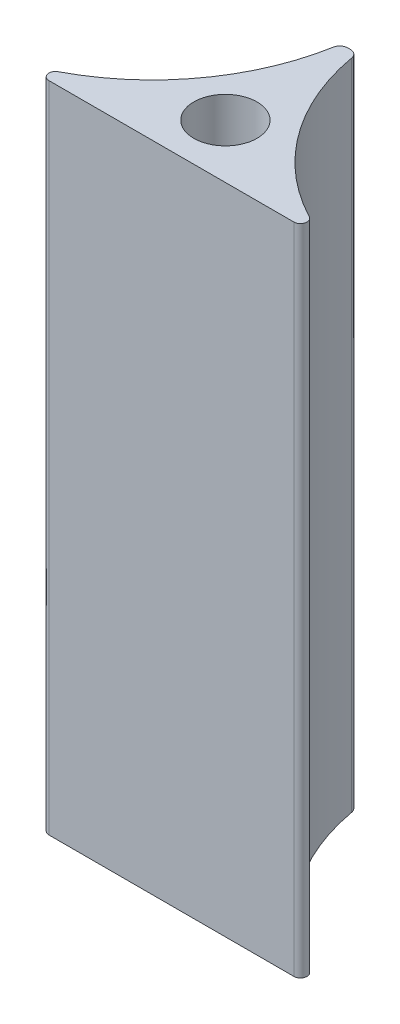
from build123d import *

# Parameters (mm, degrees)
BOSS_EXTRUDE1_DEPTH          = 50.8
F_10_0_1935_DIAMETER_HOLE1_D = 4.9149
FILLET1_R                    = 0.635


with BuildPart() as part:
    # Sketch1 → Boss-Extrude1 (new body)
    with BuildSketch(Plane(origin=(0, 0, 0), x_dir=(1, 0, 0), z_dir=(0, 1, 0))):
        with BuildLine():
            Line((0.635, -2.54), (-0.635, -2.54))
            ThreePointArc((-0.635, -2.54), (-3.656325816, -10.066426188), (-9.76110213, -15.40564027))
            ThreePointArc((-9.76110213, -15.40564027), (-10.018235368, -15.977024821), (-9.525, -16.363439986))
            Line((-9.525, -16.363439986), (9.525, -16.363439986))
            ThreePointArc((9.525, -16.363439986), (10.018235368, -15.977024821), (9.76110213, -15.40564027))
            ThreePointArc((9.76110213, -15.40564027), (3.656325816, -10.066426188), (0.635, -2.54))
        make_face()
    extrude(amount=BOSS_EXTRUDE1_DEPTH)

    # 10 _0.1935_ Diameter Hole1 (through all)
    with Locations(Plane(origin=(0, 50.8, 0), x_dir=(1, 0, 0), z_dir=(0, 1, 0))):
        with Locations((0, -12.163894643)):
            Hole(F_10_0_1935_DIAMETER_HOLE1_D / 2)

    # Fillet1
    fillet1_edges = [part.edges().sort_by_distance(p)[0] for p in [
        (-0.635, 25.4, 2.54),
        (0.635, 25.4, 2.54),
    ]]
    fillet(fillet1_edges, radius=FILLET1_R)


solid = part.part
